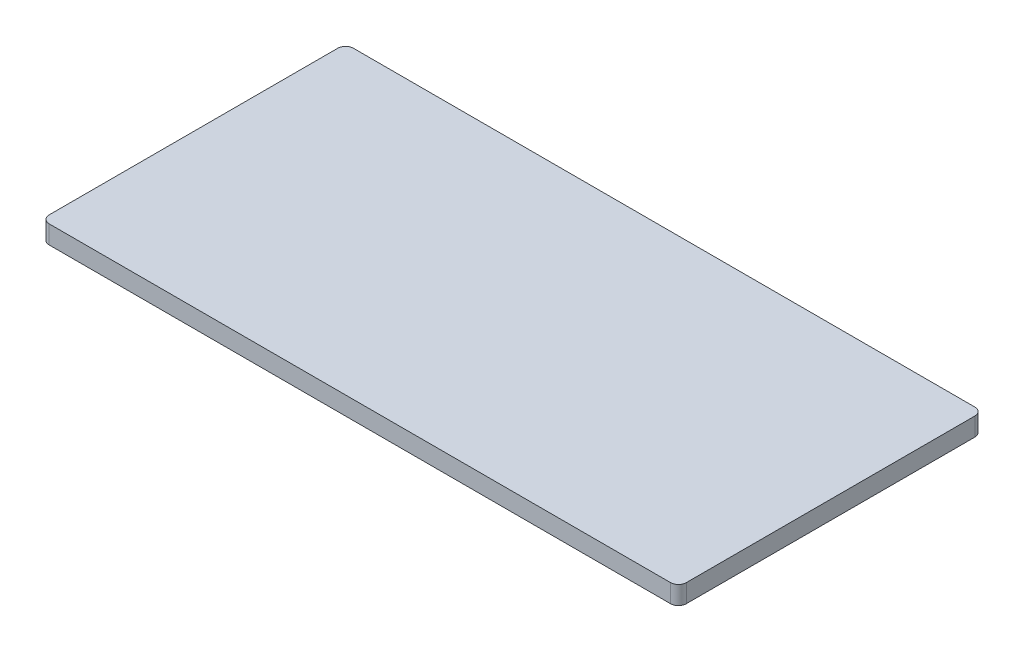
from build123d import *

# Parameters (mm, degrees)
BOSS_EXTRUDE1_DEPTH = 5
BOSS_EXTRUDE1_DRAFT = -45
SKETCH2_W           = 1200
SKETCH2_H           = 600
BOSS_EXTRUDE2_DEPTH = 28
FILLET1_R           = 2
SKETCH5_OUTSIDE_W   = 1470.41
SKETCH5_OUTSIDE_H   = 870.41
CUT_EXTRUDE1_DEPTH  = 672.631595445
BOSS_EXTRUDE3_DEPTH = 4
BOSS_EXTRUDE3_TAPER = 45
FILLET2_R           = 2


with BuildPart() as part:
    # Sketch1 → Boss-Extrude1 (with draft: the straight prism first)
    with BuildSketch(Plane(origin=(0, 0, 0), x_dir=(1, 0, 0), z_dir=(0, 1, 0))):
        with BuildLine():
            ThreePointArc((-560, 280), (-574.142135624, 274.142135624), (-580, 260))
            Line((-580, 260), (-580, -260))
            ThreePointArc((-580, -260), (-574.142135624, -274.142135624), (-560, -280))
            Line((-560, -280), (560, -280))
            ThreePointArc((560, -280), (574.142135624, -274.142135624), (580, -260))
            Line((580, -260), (580, 260))
            ThreePointArc((580, 260), (574.142135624, 274.142135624), (560, 280))
            Line((560, 280), (-560, 280))
        make_face()
    extrude(amount=-BOSS_EXTRUDE1_DEPTH)
    # Boss-Extrude1: the draft: its side faces are tilted about the plane it starts from
    boss_extrude1_sides = [part.faces().sort_by_distance(p)[0] for p in [
        (-574.142135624, -2.5, -274.142135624),
        (-580, -2.5, 0),
        (-574.142135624, -2.5, 274.142135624),
        (0, -2.5, 280),
        (574.142135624, -2.5, 274.142135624),
        (580, -2.5, 0),
        (574.142135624, -2.5, -274.142135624),
        (0, -2.5, -280),
    ]]
    draft(boss_extrude1_sides, Plane(origin=(0, 0, 0), x_dir=(1, 0, 0), z_dir=(0, 1, 0)), BOSS_EXTRUDE1_DRAFT)

    # Sketch2 → Boss-Extrude2 (add)
    with BuildSketch(Plane(origin=(0, 0, 0), x_dir=(1, 0, 0), z_dir=(0, 1, 0))):
        Rectangle(SKETCH2_W, SKETCH2_H)
    extrude(amount=BOSS_EXTRUDE2_DEPTH)

    # Fillet1
    fillet1_edges = [part.edges().sort_by_distance(p)[0] for p in [
        (-570.606601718, -5, -270.606601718),
        (0, 0, -280),
        (574.142135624, 0, -274.142135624),
        (-575, -5, 0),
        (-570.606601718, -5, 270.606601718),
        (0, -5, 275),
        (570.606601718, -5, 270.606601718),
        (575, -5, 0),
        (570.606601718, -5, -270.606601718),
        (0, -5, -275),
        (580, 0, 0),
        (574.142135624, 0, 274.142135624),
        (0, 0, 280),
        (-574.142135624, 0, 274.142135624),
        (-580, 0, 0),
        (-574.142135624, 0, -274.142135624),
    ]]
    fillet(fillet1_edges, radius=FILLET1_R)

    # Sketch5 outside → Cut-Extrude1 (cut, through all)
    with BuildSketch(Plane.XZ.offset(5)):
        Rectangle(SKETCH5_OUTSIDE_W, SKETCH5_OUTSIDE_H)
        with BuildLine():
            Line((-560, -274.171572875), (560, -274.171572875))
            ThreePointArc((560, -274.171572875), (570.02081528, -270.02081528), (574.171572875, -260))
            Line((574.171572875, -260), (574.171572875, 260))
            ThreePointArc((574.171572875, 260), (570.02081528, 270.02081528), (560, 274.171572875))
            Line((560, 274.171572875), (-560, 274.171572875))
            ThreePointArc((-560, 274.171572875), (-570.02081528, 270.02081528), (-574.171572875, 260))
            Line((-574.171572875, 260), (-574.171572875, -260))
            ThreePointArc((-574.171572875, -260), (-570.02081528, -270.02081528), (-560, -274.171572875))
        make_face(mode=Mode.SUBTRACT)
    extrude(amount=-CUT_EXTRUDE1_DEPTH, mode=Mode.SUBTRACT)

    # Sketch6 → Boss-Extrude3 (add)
    with BuildSketch(Plane.XZ.offset(5)):
        with BuildLine():
            Line((539.171572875, 259.171572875), (108.893202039, 259.171572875))
            ThreePointArc((108.893202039, 259.171572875), (100.366750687, 257.934389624), (92.543551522, 254.324881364))
            Line((92.543551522, 254.324881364), (16.349650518, 204.798845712))
            ThreePointArc((16.349650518, 204.798845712), (0, 199.952154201), (-16.349650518, 204.798845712))
            Line((-16.349650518, 204.798845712), (-92.543551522, 254.324881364))
            ThreePointArc((-92.543551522, 254.324881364), (-100.366750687, 257.934389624), (-108.893202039, 259.171572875))
            Line((-108.893202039, 259.171572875), (-539.171572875, 259.171572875))
            ThreePointArc((-539.171572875, 259.171572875), (-553.313708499, 253.313708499), (-559.171572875, 239.171572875))
            Line((-559.171572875, 239.171572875), (-559.171572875, -239.171572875))
            ThreePointArc((-559.171572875, -239.171572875), (-553.313708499, -253.313708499), (-539.171572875, -259.171572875))
            Line((-539.171572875, -259.171572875), (539.171572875, -259.171572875))
            ThreePointArc((539.171572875, -259.171572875), (553.313708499, -253.313708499), (559.171572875, -239.171572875))
            Line((559.171572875, -239.171572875), (559.171572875, 239.171572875))
            ThreePointArc((559.171572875, 239.171572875), (553.313708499, 253.313708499), (539.171572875, 259.171572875))
        make_face()
    extrude(amount=BOSS_EXTRUDE3_DEPTH, taper=BOSS_EXTRUDE3_TAPER)

    # Fillet2
    fillet2_edges = [part.edges().sort_by_distance(p)[0] for p in [
        (-553.313708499, -5, 253.313708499),
        (-559.171572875, -5, 0),
        (-553.313708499, -5, -253.313708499),
        (0, -5, -259.171572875),
        (553.313708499, -5, -253.313708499),
        (559.171572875, -5, 0),
        (553.313708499, -5, 253.313708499),
        (324.032387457, -5, 259.171572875),
        (100.366750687, -5, 257.934389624),
        (54.44660102, -5, 229.561863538),
        (0, -5, 199.952154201),
        (-54.44660102, -5, 229.561863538),
        (-100.366750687, -5, 257.934389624),
        (-324.032387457, -5, 259.171572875),
        (-550.485281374, -9, 250.485281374),
        (-555.171572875, -9, 0),
        (-550.485281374, -9, -250.485281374),
        (0, -9, -255.171572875),
        (550.485281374, -9, -250.485281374),
        (555.171572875, -9, 0),
        (550.485281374, -9, 250.485281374),
        (324.032387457, -9, 255.171572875),
        (101.503610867, -9, 254.099347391),
        (56.626554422, -9, 226.208089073),
        (0, -9, 195.952154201),
        (-56.626554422, -9, 226.208089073),
        (-101.503610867, -9, 254.099347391),
        (-324.032387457, -9, 255.171572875),
    ]]
    fillet(fillet2_edges, radius=FILLET2_R)


solid = part.part
